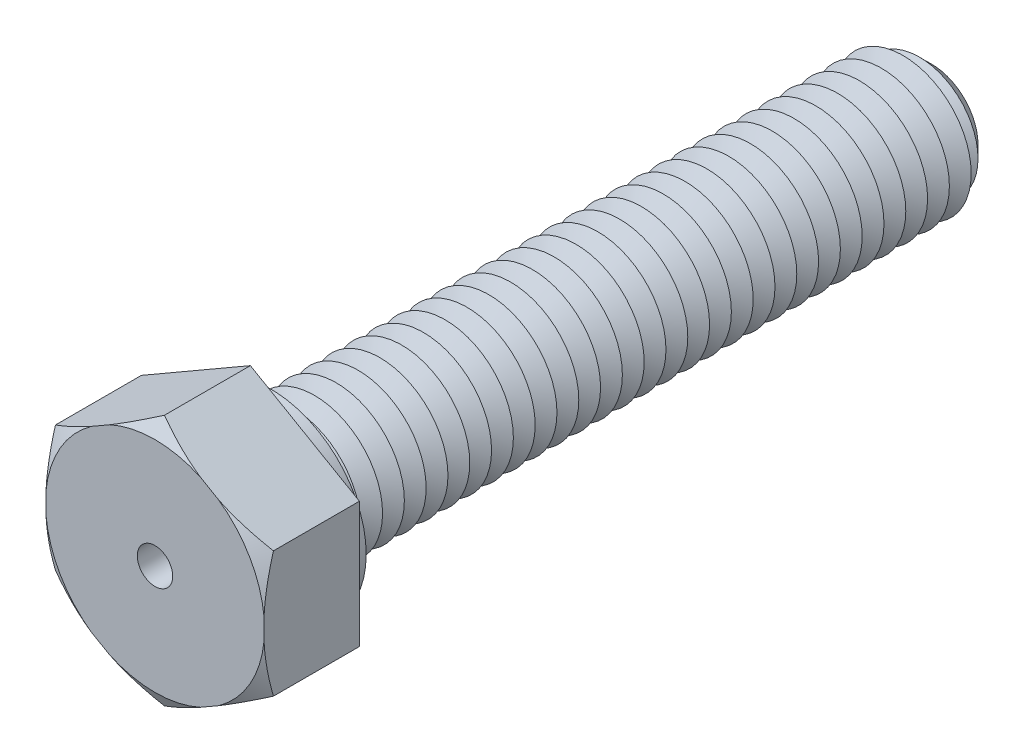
from build123d import *

# Parameters (mm, degrees)
BOSS_EXTRUDE1_DEPTH = 3.5
SKETCH3_R           = 2.5
BOSS_EXTRUDE2_DEPTH = 25
SKETCH4_R           = 3.5
BOSS_EXTRUDE3_DEPTH = 0.75
CHAMFER1_SIZE       = 0.8
LPATTERN1_COUNT     = 30
LPATTERN1_PITCH     = 0.8
SKETCH8_R           = 0.65
CUT_EXTRUDE1_DEPTH  = 28.5


with BuildPart() as part:
    # Sketch2 → Boss-Extrude1 (new body)
    with BuildSketch(Plane.XY):
        Polygon((0, 4.618802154), (-4, 2.309401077), (-4, -2.309401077), (0, -4.618802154), (4, -2.309401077), (4, 2.309401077), align=None)
    extrude(amount=BOSS_EXTRUDE1_DEPTH)

    # Sketch3 → Boss-Extrude2 (add)
    with BuildSketch(Plane(origin=(0, 0, 0), x_dir=(-1, 0, 0), z_dir=(0, 0, -1))):
        Circle(SKETCH3_R)
    extrude(amount=BOSS_EXTRUDE2_DEPTH)

    # Sketch4 → Boss-Extrude3 (add)
    with BuildSketch(Plane(origin=(0, 0, 0), x_dir=(-1, 0, 0), z_dir=(0, 0, -1))):
        with Locations(Location((0, 0, 0), (0, 0, 180))):
            Circle(SKETCH4_R)
    extrude(amount=BOSS_EXTRUDE3_DEPTH)

    # Chamfer1
    chamfer1_edges = [part.edges().sort_by_distance(p)[0] for p in [
        (2.5, 0, -25),
    ]]
    chamfer(chamfer1_edges, length=CHAMFER1_SIZE)

    # Sketch6 → Cut-Revolve1 (revolve, cut)
    with BuildSketch(Plane(origin=(0, 0, 0), x_dir=(0, 0, -1), z_dir=(1, 0, 0)), mode=Mode.PRIVATE) as cut_revolve1_sk:
        Polygon((0.75, 2.5), (1.15, 1.807179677), (1.55, 2.5), align=None)
    cut_revolve1 = revolve(cut_revolve1_sk.sketch.rotate(Axis((0, 0, 3.211670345), (0, 0, -1)), 90), axis=Axis((0, 0, 3.211670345), (0, 0, -1)), mode=Mode.SUBTRACT)

    # LPattern1: Cut-Revolve1 ×30
    with Locations(*[(0, 0, -i * LPATTERN1_PITCH) for i in range(1, LPATTERN1_COUNT)]):
        add(cut_revolve1, mode=Mode.SUBTRACT)

    # Sketch7 → Cut-Revolve2 (revolve, cut)
    with BuildSketch(Plane(origin=(0, 0, 0), x_dir=(0, 0, -1), z_dir=(1, 0, 0)), mode=Mode.PRIVATE) as cut_revolve2_sk:
        Polygon((-3.5, 4.618802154), (-3.5, 4.018802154), (-3.153589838, 4.618802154), align=None)
    revolve(cut_revolve2_sk.sketch.rotate(Axis((0, 0, 3.211670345), (0, 0, -1)), 90), axis=Axis((0, 0, 3.211670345), (0, 0, -1)), mode=Mode.SUBTRACT)

    # Sketch8 → Cut-Extrude1 (cut)
    with BuildSketch(Plane.XY.offset(3.5)):
        Circle(SKETCH8_R)
    extrude(amount=-CUT_EXTRUDE1_DEPTH, mode=Mode.SUBTRACT)


solid = part.part
